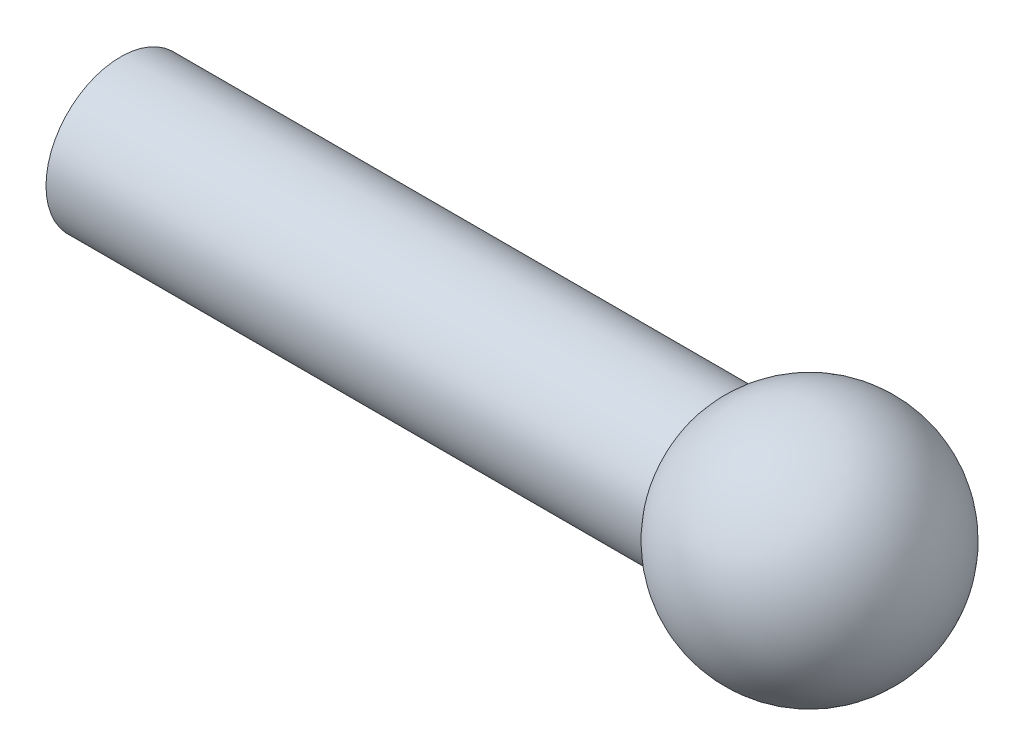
from build123d import *


with BuildPart() as part:
    # Esquisse1 → R_volution1 (revolve)
    with BuildSketch(Plane.XY):
        with BuildLine():
            Line((0, 0), (0, 2.5))
            Line((0, 2.5), (20, 2.5))
            ThreePointArc((20, 2.5), (24.447263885, 3.774254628), (27.122498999, 0))
            Line((27.122498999, 0), (0, 0))
        make_face()
    revolve(axis=Axis((-13.434480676, 0, 0), (1, 0, 0)))


solid = part.part
